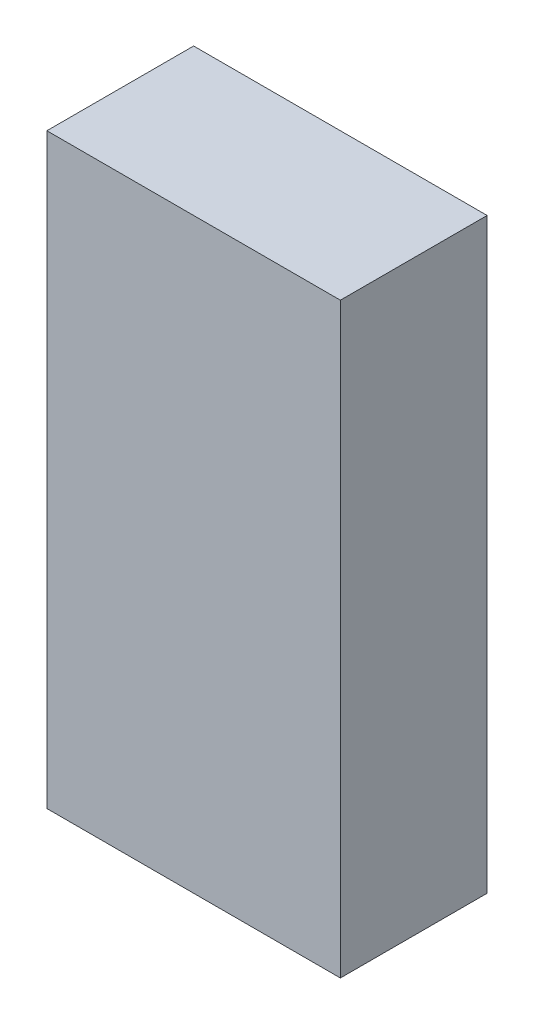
from build123d import *

# Parameters (mm, degrees)
SKETCH1_W           = 914.4
SKETCH1_H           = 457.2
BOSS_EXTRUDE1_DEPTH = 1828.8


with BuildPart() as part:
    # Sketch1 → Boss-Extrude1 (new body)
    with BuildSketch(Plane(origin=(0, 0, 0), x_dir=(1, 0, 0), z_dir=(0, 1, 0))):
        Rectangle(SKETCH1_W, SKETCH1_H)
    extrude(amount=BOSS_EXTRUDE1_DEPTH)


solid = part.part
